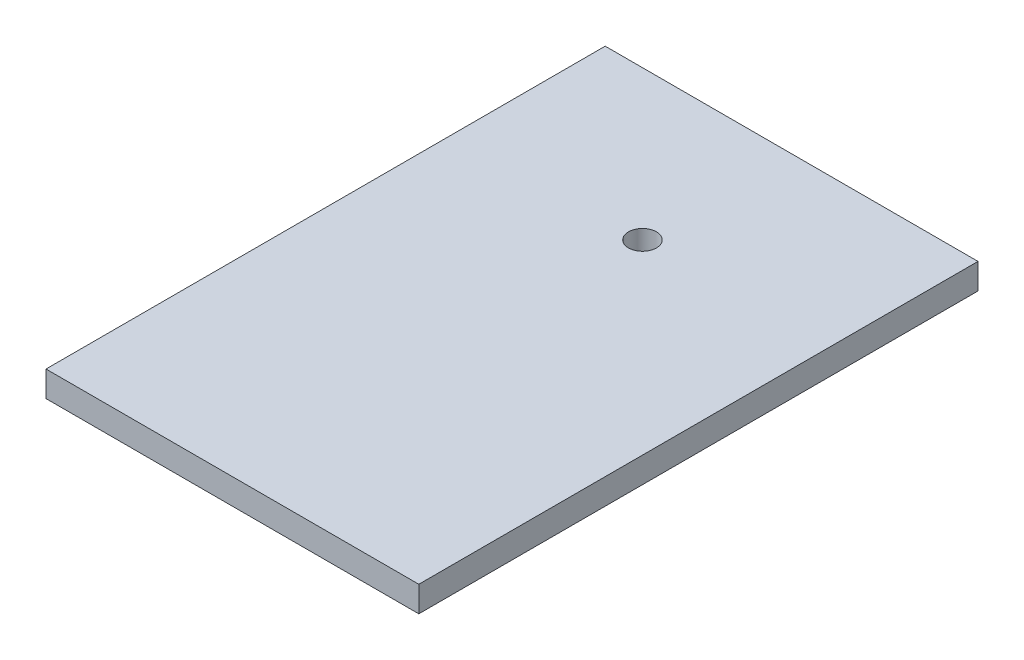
from build123d import *

# Parameters (mm, degrees)
SKETCH1_W           = 254
SKETCH1_H           = 17.4625
BOSS_EXTRUDE1_DEPTH = 381
SKETCH2_R           = 9.525
CUT_EXTRUDE1_DEPTH  = 402.988729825


with BuildPart() as part:
    # Sketch1 → Boss-Extrude1 (new body)
    with BuildSketch(Plane.XY):
        Rectangle(SKETCH1_W, SKETCH1_H)
    extrude(amount=-BOSS_EXTRUDE1_DEPTH)

    # Sketch2 → Cut-Extrude1 (cut, through all)
    with BuildSketch(Plane(origin=(0, 8.73125, 0), x_dir=(1, 0, 0), z_dir=(0, 1, 0))):
        with Locations(Location((0, 279.4, 0), (0, 0, 270))):
            Circle(SKETCH2_R)
    extrude(amount=-CUT_EXTRUDE1_DEPTH, mode=Mode.SUBTRACT)


solid = part.part
